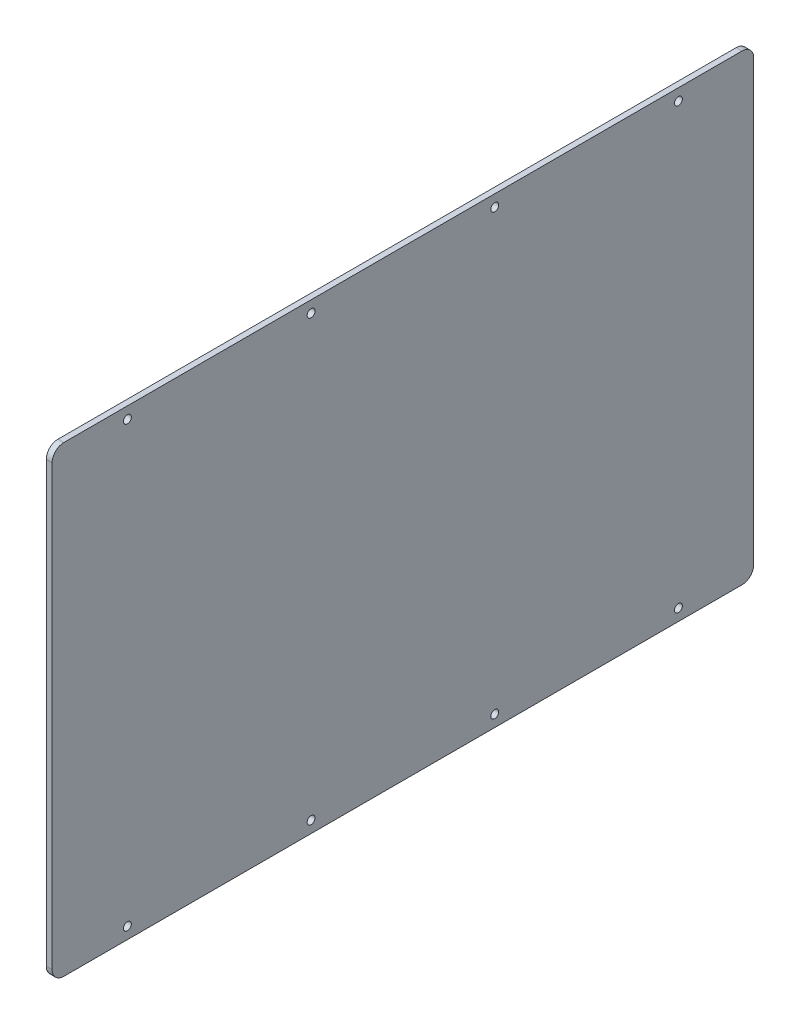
ISO-10303-21;
HEADER;
FILE_DESCRIPTION(('STEP AP214'),'2;1');
FILE_NAME('part.step','',(''),(''),'','','');
FILE_SCHEMA(('AUTOMOTIVE_DESIGN { 1 0 10303 214 1 1 1 1 }'));
ENDSEC;
DATA;
#1=APPLICATION_CONTEXT('core data for automotive mechanical design processes');
#2=APPLICATION_PROTOCOL_DEFINITION('international standard','automotive_design',2000,#1);
#3=PRODUCT_CONTEXT('',#1,'mechanical');
#4=PRODUCT('Part','Part','',(#3));
#5=PRODUCT_RELATED_PRODUCT_CATEGORY('part','',(#4));
#6=PRODUCT_DEFINITION_FORMATION('','',#4);
#7=PRODUCT_DEFINITION_CONTEXT('part definition',#1,'design');
#8=PRODUCT_DEFINITION('design','',#6,#7);
#9=PRODUCT_DEFINITION_SHAPE('','',#8);
#10=(LENGTH_UNIT() NAMED_UNIT(*) SI_UNIT(.MILLI.,.METRE.));
#11=(NAMED_UNIT(*) PLANE_ANGLE_UNIT() SI_UNIT($,.RADIAN.));
#12=(NAMED_UNIT(*) SI_UNIT($,.STERADIAN.) SOLID_ANGLE_UNIT());
#13=UNCERTAINTY_MEASURE_WITH_UNIT(LENGTH_MEASURE(1.E-05),#10,'distance_accuracy_value','');
#14=(GEOMETRIC_REPRESENTATION_CONTEXT(3) GLOBAL_UNCERTAINTY_ASSIGNED_CONTEXT((#13)) GLOBAL_UNIT_ASSIGNED_CONTEXT((#10,
#11,#12)) REPRESENTATION_CONTEXT('',''));
#15=CARTESIAN_POINT('',(0.,0.,0.));
#16=DIRECTION('',(0.,0.,1.));
#17=DIRECTION('',(1.,0.,0.));
#18=AXIS2_PLACEMENT_3D('',#15,#16,#17);
#19=CARTESIAN_POINT('',(-3.175,-23.114,0.));
#20=DIRECTION('',(0.,0.,1.));
#21=DIRECTION('',(1.,0.,0.));
#22=AXIS2_PLACEMENT_3D('',#19,#20,#21);
#23=PLANE('',#22);
#24=DIRECTION('',(0.,-1.,0.));
#25=VECTOR('',#24,1.);
#26=CARTESIAN_POINT('',(-3.175,-23.114,0.));
#27=LINE('',#26,#25);
#28=CARTESIAN_POINT('',(-3.175,222.25,0.));
#29=VERTEX_POINT('',#28);
#30=CARTESIAN_POINT('',(-3.175,-16.764,0.));
#31=VERTEX_POINT('',#30);
#32=EDGE_CURVE('E171',#29,#31,#27,.T.);
#33=ORIENTED_EDGE('',*,*,#32,.T.);
#34=DIRECTION('',(1.,0.,0.));
#35=VECTOR('',#34,1.);
#36=CARTESIAN_POINT('',(-3.175,-16.764,0.));
#37=LINE('',#36,#35);
#38=CARTESIAN_POINT('',(0.,-16.764,0.));
#39=VERTEX_POINT('',#38);
#40=EDGE_CURVE('E118',#31,#39,#37,.T.);
#41=ORIENTED_EDGE('',*,*,#40,.T.);
#42=DIRECTION('',(0.,-1.,0.));
#43=VECTOR('',#42,1.);
#44=CARTESIAN_POINT('',(0.,-23.114,0.));
#45=LINE('',#44,#43);
#46=CARTESIAN_POINT('',(0.,222.25,0.));
#47=VERTEX_POINT('',#46);
#48=EDGE_CURVE('E110',#47,#39,#45,.T.);
#49=ORIENTED_EDGE('',*,*,#48,.F.);
#50=DIRECTION('',(1.,0.,0.));
#51=VECTOR('',#50,1.);
#52=CARTESIAN_POINT('',(-3.175,222.25,0.));
#53=LINE('',#52,#51);
#54=EDGE_CURVE('E123',#47,#29,#53,.F.);
#55=ORIENTED_EDGE('',*,*,#54,.T.);
#56=EDGE_LOOP('',(#33,#41,#49,#55));
#57=FACE_BOUND('',#56,.T.);
#58=ADVANCED_FACE('F41',(#57),#23,.T.);
#59=CARTESIAN_POINT('',(-3.175,228.6,0.));
#60=DIRECTION('',(0.,1.,0.));
#61=DIRECTION('',(0.,0.,1.));
#62=AXIS2_PLACEMENT_3D('',#59,#60,#61);
#63=PLANE('',#62);
#64=DIRECTION('',(0.,0.,1.));
#65=VECTOR('',#64,1.);
#66=CARTESIAN_POINT('',(0.,228.6,0.));
#67=LINE('',#66,#65);
#68=CARTESIAN_POINT('',(0.,228.6,-375.65));
#69=VERTEX_POINT('',#68);
#70=CARTESIAN_POINT('',(0.,228.6,-6.35));
#71=VERTEX_POINT('',#70);
#72=EDGE_CURVE('E112',#69,#71,#67,.T.);
#73=ORIENTED_EDGE('',*,*,#72,.F.);
#74=DIRECTION('',(1.,0.,0.));
#75=VECTOR('',#74,1.);
#76=CARTESIAN_POINT('',(-3.175,228.6,-375.65));
#77=LINE('',#76,#75);
#78=CARTESIAN_POINT('',(-3.175,228.6,-375.65));
#79=VERTEX_POINT('',#78);
#80=EDGE_CURVE('E11',#69,#79,#77,.F.);
#81=ORIENTED_EDGE('',*,*,#80,.T.);
#82=DIRECTION('',(0.,0.,1.));
#83=VECTOR('',#82,1.);
#84=CARTESIAN_POINT('',(-3.175,228.6,0.));
#85=LINE('',#84,#83);
#86=CARTESIAN_POINT('',(-3.175,228.6,-6.35));
#87=VERTEX_POINT('',#86);
#88=EDGE_CURVE('E131',#79,#87,#85,.T.);
#89=ORIENTED_EDGE('',*,*,#88,.T.);
#90=DIRECTION('',(1.,0.,0.));
#91=VECTOR('',#90,1.);
#92=CARTESIAN_POINT('',(-3.175,228.6,-6.35));
#93=LINE('',#92,#91);
#94=EDGE_CURVE('E49',#87,#71,#93,.T.);
#95=ORIENTED_EDGE('',*,*,#94,.T.);
#96=EDGE_LOOP('',(#73,#81,#89,#95));
#97=FACE_BOUND('',#96,.T.);
#98=ADVANCED_FACE('F160',(#97),#63,.T.);
#99=CARTESIAN_POINT('',(-3.175,-23.114,-382.));
#100=DIRECTION('',(0.,0.,-1.));
#101=DIRECTION('',(-1.,0.,0.));
#102=AXIS2_PLACEMENT_3D('',#99,#100,#101);
#103=PLANE('',#102);
#104=DIRECTION('',(0.,1.,0.));
#105=VECTOR('',#104,1.);
#106=CARTESIAN_POINT('',(0.,-23.114,-382.));
#107=LINE('',#106,#105);
#108=CARTESIAN_POINT('',(0.,-16.764,-382.));
#109=VERTEX_POINT('',#108);
#110=CARTESIAN_POINT('',(0.,222.25,-382.));
#111=VERTEX_POINT('',#110);
#112=EDGE_CURVE('E169',#109,#111,#107,.T.);
#113=ORIENTED_EDGE('',*,*,#112,.F.);
#114=DIRECTION('',(1.,0.,0.));
#115=VECTOR('',#114,1.);
#116=CARTESIAN_POINT('',(-3.175,-16.764,-382.));
#117=LINE('',#116,#115);
#118=CARTESIAN_POINT('',(-3.175,-16.764,-382.));
#119=VERTEX_POINT('',#118);
#120=EDGE_CURVE('E63',#109,#119,#117,.F.);
#121=ORIENTED_EDGE('',*,*,#120,.T.);
#122=DIRECTION('',(0.,1.,0.));
#123=VECTOR('',#122,1.);
#124=CARTESIAN_POINT('',(-3.175,-23.114,-382.));
#125=LINE('',#124,#123);
#126=CARTESIAN_POINT('',(-3.175,222.25,-382.));
#127=VERTEX_POINT('',#126);
#128=EDGE_CURVE('E135',#119,#127,#125,.T.);
#129=ORIENTED_EDGE('',*,*,#128,.T.);
#130=DIRECTION('',(1.,0.,0.));
#131=VECTOR('',#130,1.);
#132=CARTESIAN_POINT('',(-3.175,222.25,-382.));
#133=LINE('',#132,#131);
#134=EDGE_CURVE('E156',#127,#111,#133,.T.);
#135=ORIENTED_EDGE('',*,*,#134,.T.);
#136=EDGE_LOOP('',(#113,#121,#129,#135));
#137=FACE_BOUND('',#136,.T.);
#138=ADVANCED_FACE('F168',(#137),#103,.T.);
#139=CARTESIAN_POINT('',(-3.175,-23.114,0.));
#140=DIRECTION('',(0.,-1.,0.));
#141=DIRECTION('',(0.,0.,-1.));
#142=AXIS2_PLACEMENT_3D('',#139,#140,#141);
#143=PLANE('',#142);
#144=DIRECTION('',(0.,0.,-1.));
#145=VECTOR('',#144,1.);
#146=CARTESIAN_POINT('',(0.,-23.114,0.));
#147=LINE('',#146,#145);
#148=CARTESIAN_POINT('',(0.,-23.114,-6.35));
#149=VERTEX_POINT('',#148);
#150=CARTESIAN_POINT('',(0.,-23.114,-375.65));
#151=VERTEX_POINT('',#150);
#152=EDGE_CURVE('E126',#149,#151,#147,.T.);
#153=ORIENTED_EDGE('',*,*,#152,.F.);
#154=DIRECTION('',(1.,0.,0.));
#155=VECTOR('',#154,1.);
#156=CARTESIAN_POINT('',(-3.175,-23.114,-6.35));
#157=LINE('',#156,#155);
#158=CARTESIAN_POINT('',(-3.175,-23.114,-6.35));
#159=VERTEX_POINT('',#158);
#160=EDGE_CURVE('E148',#149,#159,#157,.F.);
#161=ORIENTED_EDGE('',*,*,#160,.T.);
#162=DIRECTION('',(0.,0.,-1.));
#163=VECTOR('',#162,1.);
#164=CARTESIAN_POINT('',(-3.175,-23.114,0.));
#165=LINE('',#164,#163);
#166=CARTESIAN_POINT('',(-3.175,-23.114,-375.65));
#167=VERTEX_POINT('',#166);
#168=EDGE_CURVE('E175',#159,#167,#165,.T.);
#169=ORIENTED_EDGE('',*,*,#168,.T.);
#170=DIRECTION('',(1.,0.,0.));
#171=VECTOR('',#170,1.);
#172=CARTESIAN_POINT('',(-3.175,-23.114,-375.65));
#173=LINE('',#172,#171);
#174=EDGE_CURVE('E145',#167,#151,#173,.T.);
#175=ORIENTED_EDGE('',*,*,#174,.T.);
#176=EDGE_LOOP('',(#153,#161,#169,#175));
#177=FACE_BOUND('',#176,.T.);
#178=ADVANCED_FACE('F231',(#177),#143,.T.);
#179=CARTESIAN_POINT('',(-3.175,0.,0.));
#180=DIRECTION('',(-1.,0.,0.));
#181=DIRECTION('',(0.,0.,1.));
#182=AXIS2_PLACEMENT_3D('',#179,#180,#181);
#183=PLANE('',#182);
#184=CARTESIAN_POINT('',(-3.175,222.25,-341.));
#185=DIRECTION('',(-1.,0.,0.));
#186=DIRECTION('',(0.,0.,1.));
#187=AXIS2_PLACEMENT_3D('',#184,#185,#186);
#188=CIRCLE('',#187,2.14999999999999);
#189=CARTESIAN_POINT('',(-3.175,222.25,-338.85));
#190=VERTEX_POINT('',#189);
#191=EDGE_CURVE('E223',#190,#190,#188,.T.);
#192=ORIENTED_EDGE('',*,*,#191,.F.);
#193=EDGE_LOOP('',(#192));
#194=FACE_BOUND('',#193,.T.);
#195=CARTESIAN_POINT('',(-3.175,222.25,-241.));
#196=DIRECTION('',(-1.,0.,0.));
#197=DIRECTION('',(0.,0.,1.));
#198=AXIS2_PLACEMENT_3D('',#195,#196,#197);
#199=CIRCLE('',#198,2.14999999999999);
#200=CARTESIAN_POINT('',(-3.175,222.25,-238.85));
#201=VERTEX_POINT('',#200);
#202=EDGE_CURVE('E217',#201,#201,#199,.T.);
#203=ORIENTED_EDGE('',*,*,#202,.F.);
#204=EDGE_LOOP('',(#203));
#205=FACE_BOUND('',#204,.T.);
#206=CARTESIAN_POINT('',(-3.175,222.25,-141.));
#207=DIRECTION('',(-1.,0.,0.));
#208=DIRECTION('',(0.,0.,1.));
#209=AXIS2_PLACEMENT_3D('',#206,#207,#208);
#210=CIRCLE('',#209,2.14999999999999);
#211=CARTESIAN_POINT('',(-3.175,222.25,-138.85));
#212=VERTEX_POINT('',#211);
#213=EDGE_CURVE('E211',#212,#212,#210,.T.);
#214=ORIENTED_EDGE('',*,*,#213,.F.);
#215=EDGE_LOOP('',(#214));
#216=FACE_BOUND('',#215,.T.);
#217=CARTESIAN_POINT('',(-3.175,222.25,-40.9999999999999));
#218=DIRECTION('',(-1.,0.,0.));
#219=DIRECTION('',(0.,0.,1.));
#220=AXIS2_PLACEMENT_3D('',#217,#218,#219);
#221=CIRCLE('',#220,2.14999999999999);
#222=CARTESIAN_POINT('',(-3.175,222.25,-38.8499999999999));
#223=VERTEX_POINT('',#222);
#224=EDGE_CURVE('E205',#223,#223,#221,.T.);
#225=ORIENTED_EDGE('',*,*,#224,.F.);
#226=EDGE_LOOP('',(#225));
#227=FACE_BOUND('',#226,.T.);
#228=CARTESIAN_POINT('',(-3.175,-16.7729999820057,-40.9999999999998));
#229=DIRECTION('',(-1.,0.,0.));
#230=DIRECTION('',(0.,0.,1.));
#231=AXIS2_PLACEMENT_3D('',#228,#229,#230);
#232=CIRCLE('',#231,2.14999999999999);
#233=CARTESIAN_POINT('',(-3.175,-16.7729999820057,-38.8499999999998));
#234=VERTEX_POINT('',#233);
#235=EDGE_CURVE('E199',#234,#234,#232,.T.);
#236=ORIENTED_EDGE('',*,*,#235,.F.);
#237=EDGE_LOOP('',(#236));
#238=FACE_BOUND('',#237,.T.);
#239=CARTESIAN_POINT('',(-3.175,-16.7729999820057,-141.));
#240=DIRECTION('',(-1.,0.,0.));
#241=DIRECTION('',(0.,0.,1.));
#242=AXIS2_PLACEMENT_3D('',#239,#240,#241);
#243=CIRCLE('',#242,2.14999999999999);
#244=CARTESIAN_POINT('',(-3.175,-16.7729999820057,-138.85));
#245=VERTEX_POINT('',#244);
#246=EDGE_CURVE('E193',#245,#245,#243,.T.);
#247=ORIENTED_EDGE('',*,*,#246,.F.);
#248=EDGE_LOOP('',(#247));
#249=FACE_BOUND('',#248,.T.);
#250=CARTESIAN_POINT('',(-3.175,-16.7729999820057,-241.));
#251=DIRECTION('',(-1.,0.,0.));
#252=DIRECTION('',(0.,0.,1.));
#253=AXIS2_PLACEMENT_3D('',#250,#251,#252);
#254=CIRCLE('',#253,2.14999999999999);
#255=CARTESIAN_POINT('',(-3.175,-16.7729999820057,-238.85));
#256=VERTEX_POINT('',#255);
#257=EDGE_CURVE('E187',#256,#256,#254,.T.);
#258=ORIENTED_EDGE('',*,*,#257,.F.);
#259=EDGE_LOOP('',(#258));
#260=FACE_BOUND('',#259,.T.);
#261=CARTESIAN_POINT('',(-3.175,-16.7729999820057,-341.));
#262=DIRECTION('',(-1.,0.,0.));
#263=DIRECTION('',(0.,0.,1.));
#264=AXIS2_PLACEMENT_3D('',#261,#262,#263);
#265=CIRCLE('',#264,2.14999999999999);
#266=CARTESIAN_POINT('',(-3.175,-16.7729999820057,-338.85));
#267=VERTEX_POINT('',#266);
#268=EDGE_CURVE('E181',#267,#267,#265,.T.);
#269=ORIENTED_EDGE('',*,*,#268,.F.);
#270=EDGE_LOOP('',(#269));
#271=FACE_BOUND('',#270,.T.);
#272=ORIENTED_EDGE('',*,*,#168,.F.);
#273=CARTESIAN_POINT('',(-3.175,-16.764,-6.35));
#274=DIRECTION('',(-1.,0.,0.));
#275=DIRECTION('',(0.,0.,1.));
#276=AXIS2_PLACEMENT_3D('',#273,#274,#275);
#277=CIRCLE('',#276,6.35);
#278=EDGE_CURVE('E154',#159,#31,#277,.T.);
#279=ORIENTED_EDGE('',*,*,#278,.T.);
#280=ORIENTED_EDGE('',*,*,#32,.F.);
#281=CARTESIAN_POINT('',(-3.175,222.25,-6.35));
#282=DIRECTION('',(-1.,0.,0.));
#283=DIRECTION('',(0.,0.,1.));
#284=AXIS2_PLACEMENT_3D('',#281,#282,#283);
#285=CIRCLE('',#284,6.35);
#286=EDGE_CURVE('E130',#29,#87,#285,.T.);
#287=ORIENTED_EDGE('',*,*,#286,.T.);
#288=ORIENTED_EDGE('',*,*,#88,.F.);
#289=CARTESIAN_POINT('',(-3.175,222.25,-375.65));
#290=DIRECTION('',(-1.,0.,0.));
#291=DIRECTION('',(0.,0.,1.));
#292=AXIS2_PLACEMENT_3D('',#289,#290,#291);
#293=CIRCLE('',#292,6.35);
#294=EDGE_CURVE('E56',#79,#127,#293,.T.);
#295=ORIENTED_EDGE('',*,*,#294,.T.);
#296=ORIENTED_EDGE('',*,*,#128,.F.);
#297=CARTESIAN_POINT('',(-3.175,-16.764,-375.65));
#298=DIRECTION('',(-1.,0.,0.));
#299=DIRECTION('',(0.,0.,1.));
#300=AXIS2_PLACEMENT_3D('',#297,#298,#299);
#301=CIRCLE('',#300,6.35);
#302=EDGE_CURVE('E152',#119,#167,#301,.T.);
#303=ORIENTED_EDGE('',*,*,#302,.T.);
#304=EDGE_LOOP('',(#272,#279,#280,#287,#288,#295,#296,#303));
#305=FACE_BOUND('',#304,.T.);
#306=ADVANCED_FACE('F163',(#194,#205,#216,#227,#238,#249,#260,#271,#305),#183,.T.);
#307=CARTESIAN_POINT('',(0.,0.,0.));
#308=DIRECTION('',(-1.,0.,0.));
#309=DIRECTION('',(0.,0.,1.));
#310=AXIS2_PLACEMENT_3D('',#307,#308,#309);
#311=PLANE('',#310);
#312=CARTESIAN_POINT('',(0.,222.25,-341.));
#313=DIRECTION('',(-1.,0.,0.));
#314=DIRECTION('',(0.,0.,1.));
#315=AXIS2_PLACEMENT_3D('',#312,#313,#314);
#316=CIRCLE('',#315,2.15);
#317=CARTESIAN_POINT('',(0.,222.25,-338.85));
#318=VERTEX_POINT('',#317);
#319=EDGE_CURVE('E220',#318,#318,#316,.T.);
#320=ORIENTED_EDGE('',*,*,#319,.T.);
#321=EDGE_LOOP('',(#320));
#322=FACE_BOUND('',#321,.T.);
#323=CARTESIAN_POINT('',(0.,222.25,-241.));
#324=DIRECTION('',(-1.,0.,0.));
#325=DIRECTION('',(0.,0.,1.));
#326=AXIS2_PLACEMENT_3D('',#323,#324,#325);
#327=CIRCLE('',#326,2.15);
#328=CARTESIAN_POINT('',(0.,222.25,-238.85));
#329=VERTEX_POINT('',#328);
#330=EDGE_CURVE('E214',#329,#329,#327,.T.);
#331=ORIENTED_EDGE('',*,*,#330,.T.);
#332=EDGE_LOOP('',(#331));
#333=FACE_BOUND('',#332,.T.);
#334=CARTESIAN_POINT('',(0.,222.25,-141.));
#335=DIRECTION('',(-1.,0.,0.));
#336=DIRECTION('',(0.,0.,1.));
#337=AXIS2_PLACEMENT_3D('',#334,#335,#336);
#338=CIRCLE('',#337,2.15);
#339=CARTESIAN_POINT('',(0.,222.25,-138.85));
#340=VERTEX_POINT('',#339);
#341=EDGE_CURVE('E208',#340,#340,#338,.T.);
#342=ORIENTED_EDGE('',*,*,#341,.T.);
#343=EDGE_LOOP('',(#342));
#344=FACE_BOUND('',#343,.T.);
#345=CARTESIAN_POINT('',(0.,222.25,-40.9999999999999));
#346=DIRECTION('',(-1.,0.,0.));
#347=DIRECTION('',(0.,0.,1.));
#348=AXIS2_PLACEMENT_3D('',#345,#346,#347);
#349=CIRCLE('',#348,2.15);
#350=CARTESIAN_POINT('',(0.,222.25,-38.8499999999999));
#351=VERTEX_POINT('',#350);
#352=EDGE_CURVE('E202',#351,#351,#349,.T.);
#353=ORIENTED_EDGE('',*,*,#352,.T.);
#354=EDGE_LOOP('',(#353));
#355=FACE_BOUND('',#354,.T.);
#356=CARTESIAN_POINT('',(0.,-16.7729999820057,-40.9999999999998));
#357=DIRECTION('',(-1.,0.,0.));
#358=DIRECTION('',(0.,0.,1.));
#359=AXIS2_PLACEMENT_3D('',#356,#357,#358);
#360=CIRCLE('',#359,2.14999999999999);
#361=CARTESIAN_POINT('',(0.,-16.7729999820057,-38.8499999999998));
#362=VERTEX_POINT('',#361);
#363=EDGE_CURVE('E196',#362,#362,#360,.T.);
#364=ORIENTED_EDGE('',*,*,#363,.T.);
#365=EDGE_LOOP('',(#364));
#366=FACE_BOUND('',#365,.T.);
#367=CARTESIAN_POINT('',(0.,-16.7729999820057,-141.));
#368=DIRECTION('',(-1.,0.,0.));
#369=DIRECTION('',(0.,0.,1.));
#370=AXIS2_PLACEMENT_3D('',#367,#368,#369);
#371=CIRCLE('',#370,2.14999999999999);
#372=CARTESIAN_POINT('',(0.,-16.7729999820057,-138.85));
#373=VERTEX_POINT('',#372);
#374=EDGE_CURVE('E190',#373,#373,#371,.T.);
#375=ORIENTED_EDGE('',*,*,#374,.T.);
#376=EDGE_LOOP('',(#375));
#377=FACE_BOUND('',#376,.T.);
#378=CARTESIAN_POINT('',(0.,-16.7729999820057,-241.));
#379=DIRECTION('',(-1.,0.,0.));
#380=DIRECTION('',(0.,0.,1.));
#381=AXIS2_PLACEMENT_3D('',#378,#379,#380);
#382=CIRCLE('',#381,2.14999999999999);
#383=CARTESIAN_POINT('',(0.,-16.7729999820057,-238.85));
#384=VERTEX_POINT('',#383);
#385=EDGE_CURVE('E184',#384,#384,#382,.T.);
#386=ORIENTED_EDGE('',*,*,#385,.T.);
#387=EDGE_LOOP('',(#386));
#388=FACE_BOUND('',#387,.T.);
#389=CARTESIAN_POINT('',(0.,-16.7729999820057,-341.));
#390=DIRECTION('',(-1.,0.,0.));
#391=DIRECTION('',(0.,0.,1.));
#392=AXIS2_PLACEMENT_3D('',#389,#390,#391);
#393=CIRCLE('',#392,2.14999999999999);
#394=CARTESIAN_POINT('',(0.,-16.7729999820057,-338.85));
#395=VERTEX_POINT('',#394);
#396=EDGE_CURVE('E127',#395,#395,#393,.T.);
#397=ORIENTED_EDGE('',*,*,#396,.T.);
#398=EDGE_LOOP('',(#397));
#399=FACE_BOUND('',#398,.T.);
#400=ORIENTED_EDGE('',*,*,#48,.T.);
#401=CARTESIAN_POINT('',(0.,-16.764,-6.35));
#402=DIRECTION('',(-1.,0.,0.));
#403=DIRECTION('',(0.,0.,1.));
#404=AXIS2_PLACEMENT_3D('',#401,#402,#403);
#405=CIRCLE('',#404,6.35);
#406=EDGE_CURVE('E143',#39,#149,#405,.F.);
#407=ORIENTED_EDGE('',*,*,#406,.T.);
#408=ORIENTED_EDGE('',*,*,#152,.T.);
#409=CARTESIAN_POINT('',(0.,-16.764,-375.65));
#410=DIRECTION('',(-1.,0.,0.));
#411=DIRECTION('',(0.,0.,1.));
#412=AXIS2_PLACEMENT_3D('',#409,#410,#411);
#413=CIRCLE('',#412,6.35);
#414=EDGE_CURVE('E141',#151,#109,#413,.F.);
#415=ORIENTED_EDGE('',*,*,#414,.T.);
#416=ORIENTED_EDGE('',*,*,#112,.T.);
#417=CARTESIAN_POINT('',(0.,222.25,-375.65));
#418=DIRECTION('',(-1.,0.,0.));
#419=DIRECTION('',(0.,0.,1.));
#420=AXIS2_PLACEMENT_3D('',#417,#418,#419);
#421=CIRCLE('',#420,6.35);
#422=EDGE_CURVE('E117',#111,#69,#421,.F.);
#423=ORIENTED_EDGE('',*,*,#422,.T.);
#424=ORIENTED_EDGE('',*,*,#72,.T.);
#425=CARTESIAN_POINT('',(0.,222.25,-6.35));
#426=DIRECTION('',(-1.,0.,0.));
#427=DIRECTION('',(0.,0.,1.));
#428=AXIS2_PLACEMENT_3D('',#425,#426,#427);
#429=CIRCLE('',#428,6.35);
#430=EDGE_CURVE('E107',#71,#47,#429,.F.);
#431=ORIENTED_EDGE('',*,*,#430,.T.);
#432=EDGE_LOOP('',(#400,#407,#408,#415,#416,#423,#424,#431));
#433=FACE_BOUND('',#432,.T.);
#434=ADVANCED_FACE('F109',(#322,#333,#344,#355,#366,#377,#388,#399,#433),#311,.F.);
#435=CARTESIAN_POINT('',(-3.175,-16.764,-6.35));
#436=DIRECTION('',(1.,0.,0.));
#437=DIRECTION('',(0.,0.,-1.));
#438=AXIS2_PLACEMENT_3D('',#435,#436,#437);
#439=CYLINDRICAL_SURFACE('',#438,6.35);
#440=ORIENTED_EDGE('',*,*,#278,.F.);
#441=ORIENTED_EDGE('',*,*,#160,.F.);
#442=ORIENTED_EDGE('',*,*,#406,.F.);
#443=ORIENTED_EDGE('',*,*,#40,.F.);
#444=EDGE_LOOP('',(#440,#441,#442,#443));
#445=FACE_BOUND('',#444,.T.);
#446=ADVANCED_FACE('F270',(#445),#439,.T.);
#447=CARTESIAN_POINT('',(-3.175,-16.764,-375.65));
#448=DIRECTION('',(1.,0.,0.));
#449=DIRECTION('',(0.,0.,-1.));
#450=AXIS2_PLACEMENT_3D('',#447,#448,#449);
#451=CYLINDRICAL_SURFACE('',#450,6.35);
#452=ORIENTED_EDGE('',*,*,#302,.F.);
#453=ORIENTED_EDGE('',*,*,#120,.F.);
#454=ORIENTED_EDGE('',*,*,#414,.F.);
#455=ORIENTED_EDGE('',*,*,#174,.F.);
#456=EDGE_LOOP('',(#452,#453,#454,#455));
#457=FACE_BOUND('',#456,.T.);
#458=ADVANCED_FACE('F273',(#457),#451,.T.);
#459=CARTESIAN_POINT('',(-3.175,222.25,-375.65));
#460=DIRECTION('',(1.,0.,0.));
#461=DIRECTION('',(0.,0.,-1.));
#462=AXIS2_PLACEMENT_3D('',#459,#460,#461);
#463=CYLINDRICAL_SURFACE('',#462,6.35);
#464=ORIENTED_EDGE('',*,*,#294,.F.);
#465=ORIENTED_EDGE('',*,*,#80,.F.);
#466=ORIENTED_EDGE('',*,*,#422,.F.);
#467=ORIENTED_EDGE('',*,*,#134,.F.);
#468=EDGE_LOOP('',(#464,#465,#466,#467));
#469=FACE_BOUND('',#468,.T.);
#470=ADVANCED_FACE('F166',(#469),#463,.T.);
#471=CARTESIAN_POINT('',(-3.175,222.25,-6.35));
#472=DIRECTION('',(1.,0.,0.));
#473=DIRECTION('',(0.,0.,-1.));
#474=AXIS2_PLACEMENT_3D('',#471,#472,#473);
#475=CYLINDRICAL_SURFACE('',#474,6.35);
#476=ORIENTED_EDGE('',*,*,#286,.F.);
#477=ORIENTED_EDGE('',*,*,#54,.F.);
#478=ORIENTED_EDGE('',*,*,#430,.F.);
#479=ORIENTED_EDGE('',*,*,#94,.F.);
#480=EDGE_LOOP('',(#476,#477,#478,#479));
#481=FACE_BOUND('',#480,.T.);
#482=ADVANCED_FACE('F43',(#481),#475,.T.);
#483=CARTESIAN_POINT('',(-3.175,-16.7729999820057,-341.));
#484=DIRECTION('',(-1.,0.,0.));
#485=DIRECTION('',(0.,0.,1.));
#486=AXIS2_PLACEMENT_3D('',#483,#484,#485);
#487=CYLINDRICAL_SURFACE('',#486,2.14999999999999);
#488=ORIENTED_EDGE('',*,*,#396,.F.);
#489=EDGE_LOOP('',(#488));
#490=FACE_BOUND('',#489,.T.);
#491=ORIENTED_EDGE('',*,*,#268,.T.);
#492=EDGE_LOOP('',(#491));
#493=FACE_BOUND('',#492,.T.);
#494=ADVANCED_FACE('F247',(#490,#493),#487,.F.);
#495=CARTESIAN_POINT('',(-3.175,-16.7729999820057,-241.));
#496=DIRECTION('',(-1.,0.,0.));
#497=DIRECTION('',(0.,0.,1.));
#498=AXIS2_PLACEMENT_3D('',#495,#496,#497);
#499=CYLINDRICAL_SURFACE('',#498,2.14999999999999);
#500=ORIENTED_EDGE('',*,*,#385,.F.);
#501=EDGE_LOOP('',(#500));
#502=FACE_BOUND('',#501,.T.);
#503=ORIENTED_EDGE('',*,*,#257,.T.);
#504=EDGE_LOOP('',(#503));
#505=FACE_BOUND('',#504,.T.);
#506=ADVANCED_FACE('F249',(#502,#505),#499,.F.);
#507=CARTESIAN_POINT('',(-3.175,-16.7729999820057,-141.));
#508=DIRECTION('',(-1.,0.,0.));
#509=DIRECTION('',(0.,0.,1.));
#510=AXIS2_PLACEMENT_3D('',#507,#508,#509);
#511=CYLINDRICAL_SURFACE('',#510,2.14999999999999);
#512=ORIENTED_EDGE('',*,*,#374,.F.);
#513=EDGE_LOOP('',(#512));
#514=FACE_BOUND('',#513,.T.);
#515=ORIENTED_EDGE('',*,*,#246,.T.);
#516=EDGE_LOOP('',(#515));
#517=FACE_BOUND('',#516,.T.);
#518=ADVANCED_FACE('F256',(#514,#517),#511,.F.);
#519=CARTESIAN_POINT('',(-3.175,-16.7729999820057,-40.9999999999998));
#520=DIRECTION('',(-1.,0.,0.));
#521=DIRECTION('',(0.,0.,1.));
#522=AXIS2_PLACEMENT_3D('',#519,#520,#521);
#523=CYLINDRICAL_SURFACE('',#522,2.14999999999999);
#524=ORIENTED_EDGE('',*,*,#363,.F.);
#525=EDGE_LOOP('',(#524));
#526=FACE_BOUND('',#525,.T.);
#527=ORIENTED_EDGE('',*,*,#235,.T.);
#528=EDGE_LOOP('',(#527));
#529=FACE_BOUND('',#528,.T.);
#530=ADVANCED_FACE('F332',(#526,#529),#523,.F.);
#531=CARTESIAN_POINT('',(-3.175,222.25,-40.9999999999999));
#532=DIRECTION('',(-1.,0.,0.));
#533=DIRECTION('',(0.,0.,1.));
#534=AXIS2_PLACEMENT_3D('',#531,#532,#533);
#535=CYLINDRICAL_SURFACE('',#534,2.15);
#536=ORIENTED_EDGE('',*,*,#352,.F.);
#537=EDGE_LOOP('',(#536));
#538=FACE_BOUND('',#537,.T.);
#539=ORIENTED_EDGE('',*,*,#224,.T.);
#540=EDGE_LOOP('',(#539));
#541=FACE_BOUND('',#540,.T.);
#542=ADVANCED_FACE('F341',(#538,#541),#535,.F.);
#543=CARTESIAN_POINT('',(-3.175,222.25,-141.));
#544=DIRECTION('',(-1.,0.,0.));
#545=DIRECTION('',(0.,0.,1.));
#546=AXIS2_PLACEMENT_3D('',#543,#544,#545);
#547=CYLINDRICAL_SURFACE('',#546,2.15);
#548=ORIENTED_EDGE('',*,*,#341,.F.);
#549=EDGE_LOOP('',(#548));
#550=FACE_BOUND('',#549,.T.);
#551=ORIENTED_EDGE('',*,*,#213,.T.);
#552=EDGE_LOOP('',(#551));
#553=FACE_BOUND('',#552,.T.);
#554=ADVANCED_FACE('F350',(#550,#553),#547,.F.);
#555=CARTESIAN_POINT('',(-3.175,222.25,-241.));
#556=DIRECTION('',(-1.,0.,0.));
#557=DIRECTION('',(0.,0.,1.));
#558=AXIS2_PLACEMENT_3D('',#555,#556,#557);
#559=CYLINDRICAL_SURFACE('',#558,2.15);
#560=ORIENTED_EDGE('',*,*,#330,.F.);
#561=EDGE_LOOP('',(#560));
#562=FACE_BOUND('',#561,.T.);
#563=ORIENTED_EDGE('',*,*,#202,.T.);
#564=EDGE_LOOP('',(#563));
#565=FACE_BOUND('',#564,.T.);
#566=ADVANCED_FACE('F359',(#562,#565),#559,.F.);
#567=CARTESIAN_POINT('',(-3.175,222.25,-341.));
#568=DIRECTION('',(-1.,0.,0.));
#569=DIRECTION('',(0.,0.,1.));
#570=AXIS2_PLACEMENT_3D('',#567,#568,#569);
#571=CYLINDRICAL_SURFACE('',#570,2.15);
#572=ORIENTED_EDGE('',*,*,#319,.F.);
#573=EDGE_LOOP('',(#572));
#574=FACE_BOUND('',#573,.T.);
#575=ORIENTED_EDGE('',*,*,#191,.T.);
#576=EDGE_LOOP('',(#575));
#577=FACE_BOUND('',#576,.T.);
#578=ADVANCED_FACE('F227',(#574,#577),#571,.F.);
#579=CLOSED_SHELL('',(#58,#98,#138,#178,#306,#434,#446,#458,#470,#482,#494,#506,#518,#530,#542,
#554,#566,#578));
#580=MANIFOLD_SOLID_BREP('B2',#579);
#581=ADVANCED_BREP_SHAPE_REPRESENTATION('',(#18,#580),#14);
#582=SHAPE_DEFINITION_REPRESENTATION(#9,#581);
ENDSEC;
END-ISO-10303-21;
